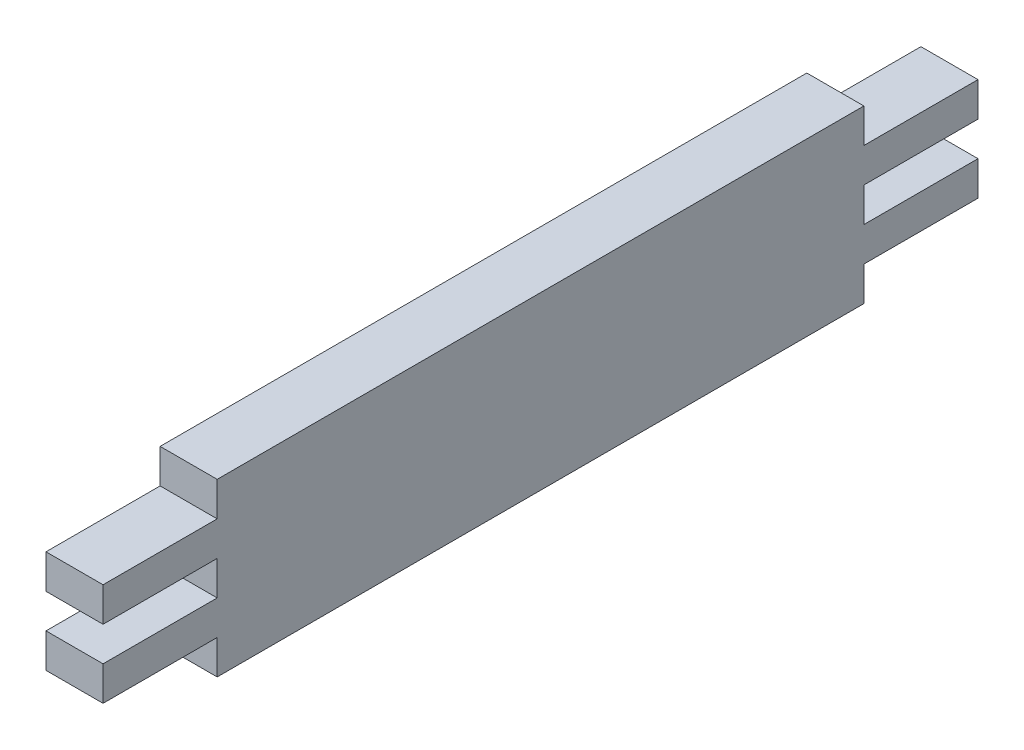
from build123d import *

# Parameters (mm, degrees)
SKETCH1_W           = 46
SKETCH1_H           = 9
BOSS_EXTRUDE1_DEPTH = 3
SKETCH2_W           = 6
SKETCH2_H           = 1.8
CUT_EXTRUDE1_DEPTH  = 10


with BuildPart() as part:
    # Sketch1 → Boss-Extrude1 (new body)
    with BuildSketch(Plane(origin=(0, 0, 0), x_dir=(0, 0, -1), z_dir=(1, 0, 0))):
        Rectangle(SKETCH1_W, SKETCH1_H)
    extrude(amount=BOSS_EXTRUDE1_DEPTH)

    # Sketch2 → Cut-Extrude1 (cut)
    with BuildSketch(Plane.ZY):
        with Locations((-20, 3.6)):
            Rectangle(SKETCH2_W, SKETCH2_H)
        with Locations((-20, 0)):
            Rectangle(SKETCH2_W, SKETCH2_H)
        with Locations((-20, -3.6)):
            Rectangle(SKETCH2_W, SKETCH2_H)
        with Locations((20, 3.6)):
            Rectangle(SKETCH2_W, SKETCH2_H)
        with Locations((20, 0)):
            Rectangle(SKETCH2_W, SKETCH2_H)
        with Locations((20, -3.6)):
            Rectangle(SKETCH2_W, SKETCH2_H)
    extrude(amount=-CUT_EXTRUDE1_DEPTH, mode=Mode.SUBTRACT)


solid = part.part
